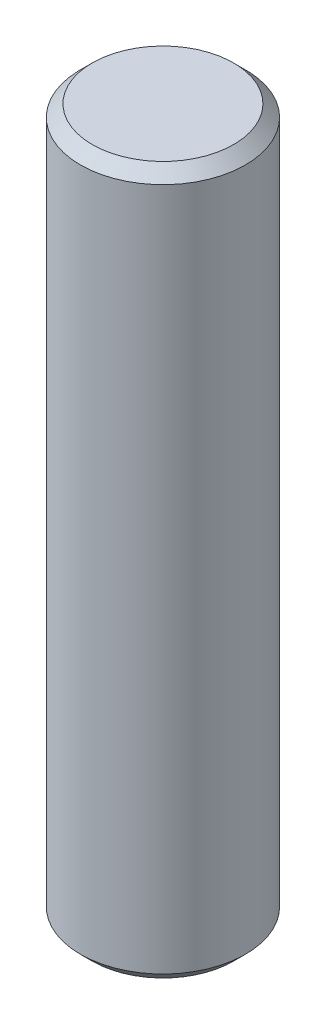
from build123d import *

# Parameters (mm, degrees)
ESQUISSE1_R        = 7
BOSS_EXTRU_1_DEPTH = 60
CHANFREIN1_SIZE    = 1


with BuildPart() as part:
    # Esquisse1 → Boss.-Extru.1 (new body)
    with BuildSketch(Plane(origin=(0, 0, 0), x_dir=(1, 0, 0), z_dir=(0, 1, 0))):
        with Locations(Location((0, 0, 0), (0, 0, 270))):
            Circle(ESQUISSE1_R)
    extrude(amount=-BOSS_EXTRU_1_DEPTH)

    # Chanfrein1
    chanfrein1_edges = [part.edges().sort_by_distance(p)[0] for p in [
        (0, 0, -7),
        (0, -60, -7),
    ]]
    chamfer(chanfrein1_edges, length=CHANFREIN1_SIZE)


solid = part.part
